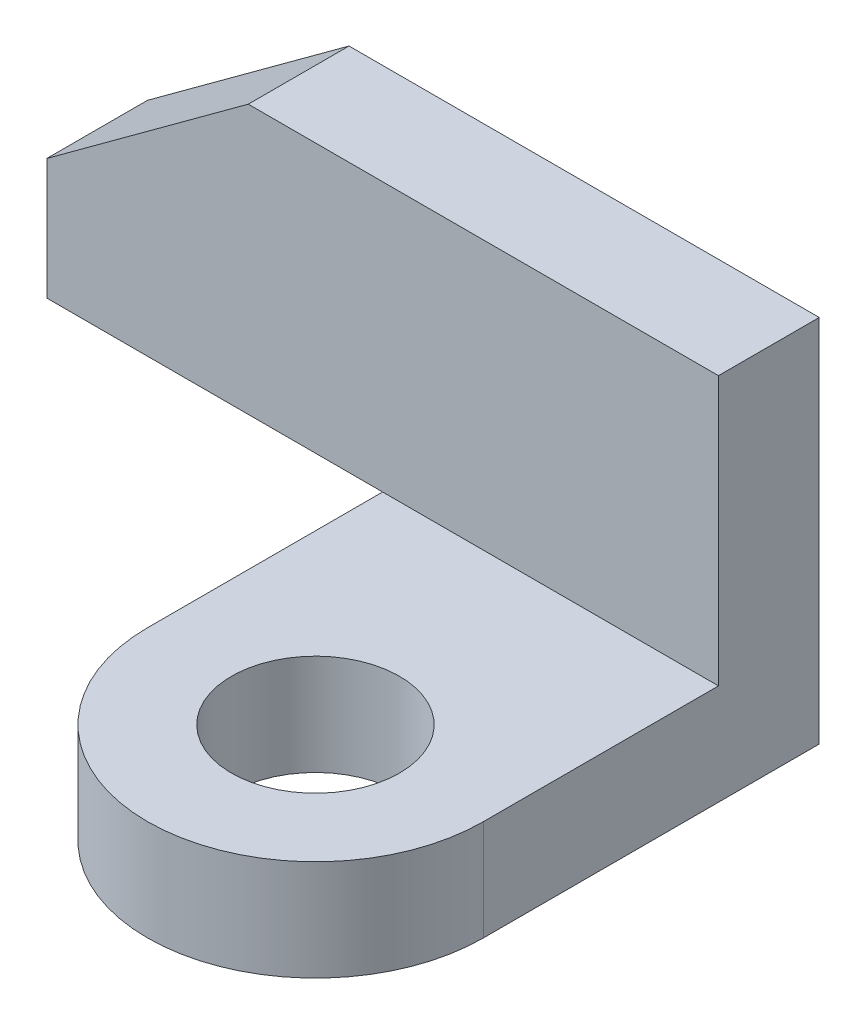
from build123d import *

# Parameters (mm, degrees)
EXTRUDE1_DEPTH = 15
SKETCH2_W      = 50
SKETCH2_H      = 75
SKETCH2_R      = 12.5
EXTRUDE2_DEPTH = 15
FILLET1_RADIUS = 25
FILLET1_LENGTH = 15


with BuildPart() as part:
    # Sketch1 → Extrude1 (new body)
    with BuildSketch(Plane.XY):
        Polygon((0, 0), (-100, 0), (-100, 18), (-70, 40), (0, 40), align=None)
    extrude(amount=EXTRUDE1_DEPTH)

    # Sketch2 → Extrude2 (add)
    with BuildSketch(Plane.XZ):
        with Locations((-25, 37.5)):
            Rectangle(SKETCH2_W, SKETCH2_H)
        with Locations((-25, 50)):
            Circle(SKETCH2_R, mode=Mode.SUBTRACT)
    extrude(amount=EXTRUDE2_DEPTH)

    # Fillet1: full round fillet: the end face becomes a half cylinder, R = half its width
    fillet1_face = Plane((-25, -7.5, 75), x_dir=(0, 1, 0), z_dir=(0, 0, 1))  # on the end face: x along it, z out of the body
    fillet1_slab = fillet1_face.offset(-FILLET1_RADIUS / 2) * Box(FILLET1_LENGTH, 2 * FILLET1_RADIUS, FILLET1_RADIUS, mode=Mode.PRIVATE)  # the body's end, R deep
    fillet1_round = Plane((-25, -7.5, 50), x_dir=(0, 0, 1), z_dir=(0, 1, 0)) * Cylinder(FILLET1_RADIUS, FILLET1_LENGTH, mode=Mode.PRIVATE)  # its axis R under the face
    add(fillet1_slab - fillet1_round, mode=Mode.SUBTRACT)


solid = part.part
